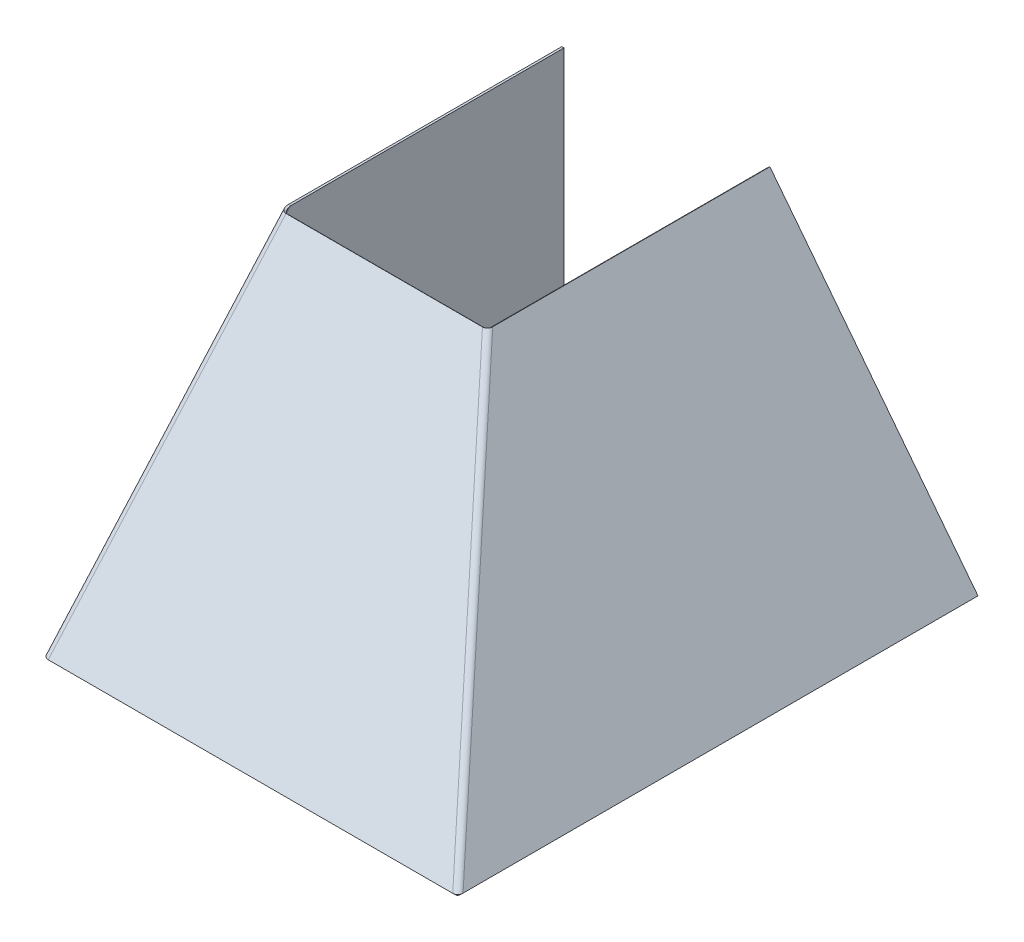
ISO-10303-21;
HEADER;
FILE_DESCRIPTION(('STEP AP214'),'2;1');
FILE_NAME('part.step','',(''),(''),'','','');
FILE_SCHEMA(('AUTOMOTIVE_DESIGN { 1 0 10303 214 1 1 1 1 }'));
ENDSEC;
DATA;
#1=APPLICATION_CONTEXT('core data for automotive mechanical design processes');
#2=APPLICATION_PROTOCOL_DEFINITION('international standard','automotive_design',2000,#1);
#3=PRODUCT_CONTEXT('',#1,'mechanical');
#4=PRODUCT('Part','Part','',(#3));
#5=PRODUCT_RELATED_PRODUCT_CATEGORY('part','',(#4));
#6=PRODUCT_DEFINITION_FORMATION('','',#4);
#7=PRODUCT_DEFINITION_CONTEXT('part definition',#1,'design');
#8=PRODUCT_DEFINITION('design','',#6,#7);
#9=PRODUCT_DEFINITION_SHAPE('','',#8);
#10=(LENGTH_UNIT() NAMED_UNIT(*) SI_UNIT(.MILLI.,.METRE.));
#11=(NAMED_UNIT(*) PLANE_ANGLE_UNIT() SI_UNIT($,.RADIAN.));
#12=(NAMED_UNIT(*) SI_UNIT($,.STERADIAN.) SOLID_ANGLE_UNIT());
#13=UNCERTAINTY_MEASURE_WITH_UNIT(LENGTH_MEASURE(1.E-05),#10,'distance_accuracy_value','');
#14=(GEOMETRIC_REPRESENTATION_CONTEXT(3) GLOBAL_UNCERTAINTY_ASSIGNED_CONTEXT((#13)) GLOBAL_UNIT_ASSIGNED_CONTEXT((#10,
#11,#12)) REPRESENTATION_CONTEXT('',''));
#15=CARTESIAN_POINT('',(0.,0.,0.));
#16=DIRECTION('',(0.,0.,1.));
#17=DIRECTION('',(1.,0.,0.));
#18=AXIS2_PLACEMENT_3D('',#15,#16,#17);
#19=CARTESIAN_POINT('',(0.,0.,0.));
#20=DIRECTION('',(0.,0.74740931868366,-0.66436383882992));
#21=DIRECTION('',(1.,0.,0.));
#22=AXIS2_PLACEMENT_3D('',#19,#20,#21);
#23=PLANE('',#22);
#24=DIRECTION('',(0.,0.66436383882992,0.74740931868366));
#25=VECTOR('',#24,1.);
#26=CARTESIAN_POINT('',(4.50000000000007,0.,0.));
#27=LINE('',#26,#25);
#28=CARTESIAN_POINT('',(4.50000000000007,-0.99654575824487,-1.12111397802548));
#29=VERTEX_POINT('',#28);
#30=CARTESIAN_POINT('',(4.50000000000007,0.,0.));
#31=VERTEX_POINT('',#30);
#32=EDGE_CURVE('E11',#29,#31,#27,.T.);
#33=ORIENTED_EDGE('',*,*,#32,.F.);
#34=DIRECTION('',(1.,0.,0.));
#35=VECTOR('',#34,1.);
#36=CARTESIAN_POINT('',(0.,-0.99654575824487,-1.12111397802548));
#37=LINE('',#36,#35);
#38=CARTESIAN_POINT('',(276.624396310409,-0.99654575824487,-1.12111397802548));
#39=VERTEX_POINT('',#38);
#40=EDGE_CURVE('E94',#29,#39,#37,.T.);
#41=ORIENTED_EDGE('',*,*,#40,.T.);
#42=DIRECTION('',(0.,0.664363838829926,0.747409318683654));
#43=VECTOR('',#42,1.);
#44=CARTESIAN_POINT('',(276.624396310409,0.,0.));
#45=LINE('',#44,#43);
#46=CARTESIAN_POINT('',(276.624396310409,0.,0.));
#47=VERTEX_POINT('',#46);
#48=EDGE_CURVE('E47',#39,#47,#45,.T.);
#49=ORIENTED_EDGE('',*,*,#48,.T.);
#50=DIRECTION('',(1.,0.,0.));
#51=VECTOR('',#50,1.);
#52=CARTESIAN_POINT('',(0.,0.,0.));
#53=LINE('',#52,#51);
#54=EDGE_CURVE('E96',#31,#47,#53,.T.);
#55=ORIENTED_EDGE('',*,*,#54,.F.);
#56=EDGE_LOOP('',(#33,#41,#49,#55));
#57=FACE_BOUND('',#56,.T.);
#58=ADVANCED_FACE('F35',(#57),#23,.F.);
#59=CARTESIAN_POINT('',(278.885076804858,0.,-0.779707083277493));
#60=CARTESIAN_POINT('',(278.67232636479,-0.38159999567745,-1.02285044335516));
#61=CARTESIAN_POINT('',(278.459575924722,-0.763199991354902,-1.26599380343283));
#62=CARTESIAN_POINT('',(278.246825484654,-1.14479998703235,-1.5091371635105));
#63=CARTESIAN_POINT('',(285.65826705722,0.,-6.70624855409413));
#64=CARTESIAN_POINT('',(284.692939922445,-0.381599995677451,-6.29088730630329));
#65=CARTESIAN_POINT('',(283.727612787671,-0.763199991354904,-5.87552605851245));
#66=CARTESIAN_POINT('',(282.762285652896,-1.14479998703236,-5.4601648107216));
#67=CARTESIAN_POINT('',(276.486359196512,0.,-17.1884289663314));
#68=CARTESIAN_POINT('',(275.946532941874,0.381599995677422,-16.2867809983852));
#69=CARTESIAN_POINT('',(275.406706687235,0.763199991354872,-15.385133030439));
#70=CARTESIAN_POINT('',(274.866880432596,1.14479998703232,-14.4834850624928));
#71=CARTESIAN_POINT('',(269.713168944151,0.,-11.2618874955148));
#72=CARTESIAN_POINT('',(269.925919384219,0.381599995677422,-11.0187441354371));
#73=CARTESIAN_POINT('',(270.138669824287,0.763199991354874,-10.7756007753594));
#74=CARTESIAN_POINT('',(270.351420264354,1.14479998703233,-10.5324574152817));
#75=CARTESIAN_POINT('',(262.939978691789,0.,-5.33534602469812));
#76=CARTESIAN_POINT('',(263.905305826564,0.381599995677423,-5.75070727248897));
#77=CARTESIAN_POINT('',(264.870632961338,0.763199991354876,-6.16606852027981));
#78=CARTESIAN_POINT('',(265.835960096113,1.14479998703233,-6.58142976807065));
#79=CARTESIAN_POINT('',(272.111886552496,0.,5.14683438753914));
#80=CARTESIAN_POINT('',(272.651712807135,-0.38159999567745,4.24518641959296));
#81=CARTESIAN_POINT('',(273.191539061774,-0.7631999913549,3.34353845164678));
#82=CARTESIAN_POINT('',(273.731365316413,-1.14479998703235,2.44189048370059));
#83=CARTESIAN_POINT('',(278.885076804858,0.,-0.779707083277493));
#84=CARTESIAN_POINT('',(278.67232636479,-0.38159999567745,-1.02285044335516));
#85=CARTESIAN_POINT('',(278.459575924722,-0.763199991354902,-1.26599380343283));
#86=CARTESIAN_POINT('',(278.246825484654,-1.14479998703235,-1.5091371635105));
#87=(BOUNDED_SURFACE() B_SPLINE_SURFACE(3,3,((#59,#60,#61,#62),(#63,#64,#65,#66),(#67,#68,#69,
#70),(#71,#72,#73,#74),(#75,#76,#77,#78),(#79,#80,#81,#82),(#83,#84,#85,#86)),.UNSPECIFIED.,.T.,
.F.,.F.) B_SPLINE_SURFACE_WITH_KNOTS((4,3,4),(4,4),(0.,0.5,1.),(0.,1.),
.UNSPECIFIED.) GEOMETRIC_REPRESENTATION_ITEM() RATIONAL_B_SPLINE_SURFACE(((1.,1.,1.,1.),
(0.333333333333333,0.333333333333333,0.333333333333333,0.333333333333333),(0.333333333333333,
0.333333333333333,0.333333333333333,0.333333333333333),(1.,1.,1.,1.),(0.333333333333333,
0.333333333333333,0.333333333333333,0.333333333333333),(0.333333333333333,0.333333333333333,
0.333333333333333,0.333333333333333),(1.,1.,1.,1.))) REPRESENTATION_ITEM('') SURFACE());
#88=CARTESIAN_POINT('',(274.299122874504,0.,-6.02079728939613));
#89=DIRECTION('',(-0.123516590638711,-0.982250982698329,-0.141161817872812));
#90=DIRECTION('',(0.646816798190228,-0.187571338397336,0.739219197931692));
#91=AXIS2_PLACEMENT_3D('',#88,#89,#90);
#92=ELLIPSE('',#91,6.10327780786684,3.);
#93=CARTESIAN_POINT('',(278.815971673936,-0.920910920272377,-3.56503483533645));
#94=VERTEX_POINT('',#93);
#95=EDGE_CURVE('E135',#39,#94,#92,.F.);
#96=DIRECTION('',(0.789352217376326,0.61394061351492,0.));
#97=VECTOR('',#96,1.);
#98=CARTESIAN_POINT('',(280.,0.,-3.56503483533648));
#99=LINE('',#98,#97);
#100=CARTESIAN_POINT('',(280.,0.,-3.56503483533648));
#101=VERTEX_POINT('',#100);
#102=EDGE_CURVE('E162',#94,#101,#99,.T.);
#103=CARTESIAN_POINT('',(274.299122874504,0.,-6.02079728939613));
#104=DIRECTION('',(0.,-1.,0.));
#105=DIRECTION('',(0.658504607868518,0.,0.752576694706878));
#106=AXIS2_PLACEMENT_3D('',#103,#104,#105);
#107=ELLIPSE('',#106,6.96419413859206,4.5);
#108=EDGE_CURVE('E171',#47,#101,#107,.F.);
#109=ORIENTED_EDGE('',*,*,#48,.F.);
#110=ORIENTED_EDGE('',*,*,#95,.T.);
#111=ORIENTED_EDGE('',*,*,#102,.T.);
#112=ORIENTED_EDGE('',*,*,#108,.F.);
#113=EDGE_LOOP('',(#109,#110,#111,#112));
#114=FACE_BOUND('',#113,.T.);
#115=ADVANCED_FACE('F170',(#114),#87,.F.);
#116=CARTESIAN_POINT('',(280.,0.,0.));
#117=DIRECTION('',(-0.61394061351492,0.789352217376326,0.));
#118=DIRECTION('',(0.,0.,-1.));
#119=AXIS2_PLACEMENT_3D('',#116,#117,#118);
#120=PLANE('',#119);
#121=ORIENTED_EDGE('',*,*,#102,.F.);
#122=DIRECTION('',(0.,0.,1.));
#123=VECTOR('',#122,1.);
#124=CARTESIAN_POINT('',(278.815971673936,-0.920910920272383,0.));
#125=LINE('',#124,#123);
#126=CARTESIAN_POINT('',(278.815971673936,-0.920910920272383,-350.));
#127=VERTEX_POINT('',#126);
#128=EDGE_CURVE('E226',#94,#127,#125,.F.);
#129=ORIENTED_EDGE('',*,*,#128,.T.);
#130=DIRECTION('',(0.789352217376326,0.61394061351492,0.));
#131=VECTOR('',#130,1.);
#132=CARTESIAN_POINT('',(280.,0.,-350.));
#133=LINE('',#132,#131);
#134=CARTESIAN_POINT('',(280.,0.,-350.));
#135=VERTEX_POINT('',#134);
#136=EDGE_CURVE('E159',#127,#135,#133,.T.);
#137=ORIENTED_EDGE('',*,*,#136,.T.);
#138=DIRECTION('',(0.,0.,-1.));
#139=VECTOR('',#138,1.);
#140=CARTESIAN_POINT('',(280.,0.,0.));
#141=LINE('',#140,#139);
#142=EDGE_CURVE('E190',#101,#135,#141,.T.);
#143=ORIENTED_EDGE('',*,*,#142,.F.);
#144=EDGE_LOOP('',(#121,#129,#137,#143));
#145=FACE_BOUND('',#144,.T.);
#146=ADVANCED_FACE('F191',(#145),#120,.F.);
#147=CARTESIAN_POINT('',(140.,180.,-350.));
#148=DIRECTION('',(0.,0.,-1.));
#149=DIRECTION('',(0.61394061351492,-0.789352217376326,0.));
#150=AXIS2_PLACEMENT_3D('',#147,#148,#149);
#151=PLANE('',#150);
#152=ORIENTED_EDGE('',*,*,#136,.F.);
#153=DIRECTION('',(0.61394061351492,-0.789352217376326,0.));
#154=VECTOR('',#153,1.);
#155=CARTESIAN_POINT('',(173.277510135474,134.771396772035,-350.));
#156=LINE('',#155,#154);
#157=CARTESIAN_POINT('',(138.815971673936,179.079089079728,-350.));
#158=VERTEX_POINT('',#157);
#159=EDGE_CURVE('E230',#158,#127,#156,.T.);
#160=ORIENTED_EDGE('',*,*,#159,.F.);
#161=DIRECTION('',(0.789352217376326,0.61394061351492,0.));
#162=VECTOR('',#161,1.);
#163=CARTESIAN_POINT('',(140.,180.,-350.));
#164=LINE('',#163,#162);
#165=CARTESIAN_POINT('',(140.,180.,-350.));
#166=VERTEX_POINT('',#165);
#167=EDGE_CURVE('E156',#158,#166,#164,.T.);
#168=ORIENTED_EDGE('',*,*,#167,.T.);
#169=DIRECTION('',(0.61394061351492,-0.789352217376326,0.));
#170=VECTOR('',#169,1.);
#171=CARTESIAN_POINT('',(140.,180.,-350.));
#172=LINE('',#171,#170);
#173=EDGE_CURVE('E197',#166,#135,#172,.T.);
#174=ORIENTED_EDGE('',*,*,#173,.T.);
#175=EDGE_LOOP('',(#152,#160,#168,#174));
#176=FACE_BOUND('',#175,.T.);
#177=ADVANCED_FACE('F241',(#176),#151,.T.);
#178=CARTESIAN_POINT('',(140.,180.,-160.));
#179=DIRECTION('',(-0.61394061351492,0.789352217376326,0.));
#180=DIRECTION('',(0.,0.,-1.));
#181=AXIS2_PLACEMENT_3D('',#178,#179,#180);
#182=PLANE('',#181);
#183=ORIENTED_EDGE('',*,*,#167,.F.);
#184=DIRECTION('',(0.,0.,1.));
#185=VECTOR('',#184,1.);
#186=CARTESIAN_POINT('',(138.815971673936,179.079089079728,0.));
#187=LINE('',#186,#185);
#188=CARTESIAN_POINT('',(138.815971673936,179.079089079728,-163.565034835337));
#189=VERTEX_POINT('',#188);
#190=EDGE_CURVE('E132',#189,#158,#187,.F.);
#191=ORIENTED_EDGE('',*,*,#190,.F.);
#192=DIRECTION('',(0.789352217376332,0.613940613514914,0.));
#193=VECTOR('',#192,1.);
#194=CARTESIAN_POINT('',(140.,180.,-163.565034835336));
#195=LINE('',#194,#193);
#196=CARTESIAN_POINT('',(140.,180.,-163.565034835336));
#197=VERTEX_POINT('',#196);
#198=EDGE_CURVE('E153',#189,#197,#195,.T.);
#199=ORIENTED_EDGE('',*,*,#198,.T.);
#200=DIRECTION('',(0.,0.,-1.));
#201=VECTOR('',#200,1.);
#202=CARTESIAN_POINT('',(140.,180.,-160.));
#203=LINE('',#202,#201);
#204=EDGE_CURVE('E202',#197,#166,#203,.T.);
#205=ORIENTED_EDGE('',*,*,#204,.T.);
#206=EDGE_LOOP('',(#183,#191,#199,#205));
#207=FACE_BOUND('',#206,.T.);
#208=ADVANCED_FACE('F290',(#207),#182,.T.);
#209=CARTESIAN_POINT('',(138.885076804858,180.,-160.779707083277));
#210=CARTESIAN_POINT('',(138.67232636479,179.618400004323,-161.022850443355));
#211=CARTESIAN_POINT('',(138.459575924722,179.236800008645,-161.265993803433));
#212=CARTESIAN_POINT('',(138.246825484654,178.855200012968,-161.509137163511));
#213=CARTESIAN_POINT('',(132.111886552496,180.,-154.853165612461));
#214=CARTESIAN_POINT('',(132.651712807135,179.618400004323,-155.754813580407));
#215=CARTESIAN_POINT('',(133.191539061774,179.236800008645,-156.656461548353));
#216=CARTESIAN_POINT('',(133.731365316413,178.855200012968,-157.558109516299));
#217=CARTESIAN_POINT('',(122.939978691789,180.,-165.335346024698));
#218=CARTESIAN_POINT('',(123.905305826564,180.381599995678,-165.750707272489));
#219=CARTESIAN_POINT('',(124.870632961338,180.763199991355,-166.16606852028));
#220=CARTESIAN_POINT('',(125.835960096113,181.144799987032,-166.581429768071));
#221=CARTESIAN_POINT('',(129.713168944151,180.,-171.261887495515));
#222=CARTESIAN_POINT('',(129.925919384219,180.381599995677,-171.018744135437));
#223=CARTESIAN_POINT('',(130.138669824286,180.763199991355,-170.775600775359));
#224=CARTESIAN_POINT('',(130.351420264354,181.144799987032,-170.532457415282));
#225=CARTESIAN_POINT('',(136.486359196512,180.,-177.188428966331));
#226=CARTESIAN_POINT('',(135.946532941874,180.381599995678,-176.286780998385));
#227=CARTESIAN_POINT('',(135.406706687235,180.763199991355,-175.385133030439));
#228=CARTESIAN_POINT('',(134.866880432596,181.144799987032,-174.483485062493));
#229=CARTESIAN_POINT('',(145.65826705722,180.,-166.706248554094));
#230=CARTESIAN_POINT('',(144.692939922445,179.618400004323,-166.290887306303));
#231=CARTESIAN_POINT('',(143.72761278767,179.236800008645,-165.875526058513));
#232=CARTESIAN_POINT('',(142.762285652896,178.855200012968,-165.460164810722));
#233=CARTESIAN_POINT('',(138.885076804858,180.,-160.779707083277));
#234=CARTESIAN_POINT('',(138.67232636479,179.618400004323,-161.022850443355));
#235=CARTESIAN_POINT('',(138.459575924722,179.236800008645,-161.265993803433));
#236=CARTESIAN_POINT('',(138.246825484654,178.855200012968,-161.509137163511));
#237=(BOUNDED_SURFACE() B_SPLINE_SURFACE(3,3,((#209,#210,#211,#212),(#213,#214,#215,#216),(#217,
#218,#219,#220),(#221,#222,#223,#224),(#225,#226,#227,#228),(#229,#230,#231,#232),(#233,#234,
#235,#236)),.UNSPECIFIED.,.T.,.F.,.F.) B_SPLINE_SURFACE_WITH_KNOTS((4,3,4),(4,4),(0.,0.5,1.),
(0.,1.),.UNSPECIFIED.) GEOMETRIC_REPRESENTATION_ITEM() RATIONAL_B_SPLINE_SURFACE(((1.,1.,1.,1.),
(0.333333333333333,0.333333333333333,0.333333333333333,0.333333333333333),(0.333333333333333,
0.333333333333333,0.333333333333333,0.333333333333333),(1.,1.,1.,1.),(0.333333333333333,
0.333333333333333,0.333333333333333,0.333333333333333),(0.333333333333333,0.333333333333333,
0.333333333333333,0.333333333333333),(1.,1.,1.,1.))) REPRESENTATION_ITEM('') SURFACE());
#238=CARTESIAN_POINT('',(134.299122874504,180.,-166.020797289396));
#239=DIRECTION('',(0.123516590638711,0.982250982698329,0.141161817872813));
#240=DIRECTION('',(0.64681679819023,-0.187571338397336,0.73921919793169));
#241=AXIS2_PLACEMENT_3D('',#238,#239,#240);
#242=ELLIPSE('',#241,6.10327780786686,3.);
#243=CARTESIAN_POINT('',(136.624396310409,179.003454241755,-161.121113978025));
#244=VERTEX_POINT('',#243);
#245=EDGE_CURVE('E130',#189,#244,#242,.F.);
#246=DIRECTION('',(0.,0.66436383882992,0.74740931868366));
#247=VECTOR('',#246,1.);
#248=CARTESIAN_POINT('',(136.624396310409,180.,-160.));
#249=LINE('',#248,#247);
#250=CARTESIAN_POINT('',(136.624396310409,180.,-160.));
#251=VERTEX_POINT('',#250);
#252=EDGE_CURVE('E151',#244,#251,#249,.T.);
#253=CARTESIAN_POINT('',(134.299122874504,180.,-166.020797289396));
#254=DIRECTION('',(0.,1.,0.));
#255=DIRECTION('',(0.658504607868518,0.,0.752576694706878));
#256=AXIS2_PLACEMENT_3D('',#253,#254,#255);
#257=ELLIPSE('',#256,6.96419413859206,4.5);
#258=EDGE_CURVE('E187',#197,#251,#257,.F.);
#259=ORIENTED_EDGE('',*,*,#198,.F.);
#260=ORIENTED_EDGE('',*,*,#245,.T.);
#261=ORIENTED_EDGE('',*,*,#252,.T.);
#262=ORIENTED_EDGE('',*,*,#258,.F.);
#263=EDGE_LOOP('',(#259,#260,#261,#262));
#264=FACE_BOUND('',#263,.T.);
#265=ADVANCED_FACE('F292',(#264),#237,.F.);
#266=CARTESIAN_POINT('',(0.,180.,-160.));
#267=DIRECTION('',(0.,0.74740931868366,-0.66436383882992));
#268=DIRECTION('',(1.,0.,0.));
#269=AXIS2_PLACEMENT_3D('',#266,#267,#268);
#270=PLANE('',#269);
#271=ORIENTED_EDGE('',*,*,#252,.F.);
#272=DIRECTION('',(1.,0.,0.));
#273=VECTOR('',#272,1.);
#274=CARTESIAN_POINT('',(0.,179.003454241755,-161.121113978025));
#275=LINE('',#274,#273);
#276=CARTESIAN_POINT('',(4.50000000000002,179.003454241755,-161.121113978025));
#277=VERTEX_POINT('',#276);
#278=EDGE_CURVE('E125',#277,#244,#275,.T.);
#279=ORIENTED_EDGE('',*,*,#278,.F.);
#280=DIRECTION('',(0.,0.664363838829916,0.747409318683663));
#281=VECTOR('',#280,1.);
#282=CARTESIAN_POINT('',(4.50000000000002,180.,-160.));
#283=LINE('',#282,#281);
#284=CARTESIAN_POINT('',(4.50000000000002,180.,-160.));
#285=VERTEX_POINT('',#284);
#286=EDGE_CURVE('E148',#277,#285,#283,.T.);
#287=ORIENTED_EDGE('',*,*,#286,.T.);
#288=DIRECTION('',(1.,0.,0.));
#289=VECTOR('',#288,1.);
#290=CARTESIAN_POINT('',(0.,180.,-160.));
#291=LINE('',#290,#289);
#292=EDGE_CURVE('E196',#285,#251,#291,.T.);
#293=ORIENTED_EDGE('',*,*,#292,.T.);
#294=EDGE_LOOP('',(#271,#279,#287,#293));
#295=FACE_BOUND('',#294,.T.);
#296=ADVANCED_FACE('F295',(#295),#270,.T.);
#297=CARTESIAN_POINT('',(4.50000000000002,180.,-160.));
#298=CARTESIAN_POINT('',(4.50000000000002,179.667818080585,-160.373704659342));
#299=CARTESIAN_POINT('',(4.50000000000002,179.33563616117,-160.747409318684));
#300=CARTESIAN_POINT('',(4.50000000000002,179.003454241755,-161.121113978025));
#301=CARTESIAN_POINT('',(-4.49999999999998,180.,-160.));
#302=CARTESIAN_POINT('',(-3.49999999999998,179.667818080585,-160.373704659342));
#303=CARTESIAN_POINT('',(-2.49999999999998,179.33563616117,-160.747409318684));
#304=CARTESIAN_POINT('',(-1.49999999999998,179.003454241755,-161.121113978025));
#305=CARTESIAN_POINT('',(-4.49999999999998,180.,-172.041594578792));
#306=CARTESIAN_POINT('',(-3.49999999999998,180.332181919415,-171.667889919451));
#307=CARTESIAN_POINT('',(-2.49999999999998,180.66436383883,-171.294185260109));
#308=CARTESIAN_POINT('',(-1.49999999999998,180.996545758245,-170.920480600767));
#309=CARTESIAN_POINT('',(4.50000000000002,180.,-172.041594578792));
#310=CARTESIAN_POINT('',(4.50000000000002,180.332181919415,-171.66788991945));
#311=CARTESIAN_POINT('',(4.50000000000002,180.66436383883,-171.294185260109));
#312=CARTESIAN_POINT('',(4.50000000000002,180.996545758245,-170.920480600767));
#313=CARTESIAN_POINT('',(13.5,180.,-172.041594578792));
#314=CARTESIAN_POINT('',(12.5,180.332181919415,-171.667889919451));
#315=CARTESIAN_POINT('',(11.5,180.66436383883,-171.294185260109));
#316=CARTESIAN_POINT('',(10.5,180.996545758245,-170.920480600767));
#317=CARTESIAN_POINT('',(13.5,180.,-160.));
#318=CARTESIAN_POINT('',(12.5,179.667818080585,-160.373704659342));
#319=CARTESIAN_POINT('',(11.5,179.33563616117,-160.747409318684));
#320=CARTESIAN_POINT('',(10.5,179.003454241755,-161.121113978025));
#321=CARTESIAN_POINT('',(4.50000000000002,180.,-160.));
#322=CARTESIAN_POINT('',(4.50000000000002,179.667818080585,-160.373704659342));
#323=CARTESIAN_POINT('',(4.50000000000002,179.33563616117,-160.747409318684));
#324=CARTESIAN_POINT('',(4.50000000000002,179.003454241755,-161.121113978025));
#325=(BOUNDED_SURFACE() B_SPLINE_SURFACE(3,3,((#297,#298,#299,#300),(#301,#302,#303,#304),(#305,
#306,#307,#308),(#309,#310,#311,#312),(#313,#314,#315,#316),(#317,#318,#319,#320),(#321,#322,
#323,#324)),.UNSPECIFIED.,.T.,.F.,.F.) B_SPLINE_SURFACE_WITH_KNOTS((4,3,4),(4,4),(0.,0.5,1.),
(0.,1.),.UNSPECIFIED.) GEOMETRIC_REPRESENTATION_ITEM() RATIONAL_B_SPLINE_SURFACE(((1.,1.,1.,1.),
(0.333333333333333,0.333333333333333,0.333333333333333,0.333333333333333),(0.333333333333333,
0.333333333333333,0.333333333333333,0.333333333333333),(1.,1.,1.,1.),(0.333333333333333,
0.333333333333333,0.333333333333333,0.333333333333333),(0.333333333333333,0.333333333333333,
0.333333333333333,0.333333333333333),(1.,1.,1.,1.))) REPRESENTATION_ITEM('') SURFACE());
#326=CARTESIAN_POINT('',(4.50000000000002,180.,-166.020797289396));
#327=DIRECTION('',(0.,0.979936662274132,0.199309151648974));
#328=DIRECTION('',(0.,-0.199309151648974,0.979936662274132));
#329=AXIS2_PLACEMENT_3D('',#326,#327,#328);
#330=ELLIPSE('',#329,5.00000000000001,3.);
#331=CARTESIAN_POINT('',(1.50000000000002,180.,-166.020797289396));
#332=VERTEX_POINT('',#331);
#333=EDGE_CURVE('E112',#277,#332,#330,.F.);
#334=DIRECTION('',(-1.,0.,0.));
#335=VECTOR('',#334,1.);
#336=CARTESIAN_POINT('',(0.,180.,-166.020797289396));
#337=LINE('',#336,#335);
#338=CARTESIAN_POINT('',(0.,180.,-166.020797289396));
#339=VERTEX_POINT('',#338);
#340=EDGE_CURVE('E145',#332,#339,#337,.T.);
#341=CARTESIAN_POINT('',(4.50000000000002,180.,-166.020797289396));
#342=DIRECTION('',(0.,1.,0.));
#343=DIRECTION('',(0.,0.,1.));
#344=AXIS2_PLACEMENT_3D('',#341,#342,#343);
#345=ELLIPSE('',#344,6.02079728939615,4.5);
#346=EDGE_CURVE('E211',#285,#339,#345,.F.);
#347=ORIENTED_EDGE('',*,*,#286,.F.);
#348=ORIENTED_EDGE('',*,*,#333,.T.);
#349=ORIENTED_EDGE('',*,*,#340,.T.);
#350=ORIENTED_EDGE('',*,*,#346,.F.);
#351=EDGE_LOOP('',(#347,#348,#349,#350));
#352=FACE_BOUND('',#351,.T.);
#353=ADVANCED_FACE('F335',(#352),#325,.F.);
#354=CARTESIAN_POINT('',(0.,180.,-350.));
#355=DIRECTION('',(0.,1.,0.));
#356=DIRECTION('',(0.,0.,1.));
#357=AXIS2_PLACEMENT_3D('',#354,#355,#356);
#358=PLANE('',#357);
#359=ORIENTED_EDGE('',*,*,#340,.F.);
#360=DIRECTION('',(0.,0.,-1.));
#361=VECTOR('',#360,1.);
#362=CARTESIAN_POINT('',(1.50000000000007,180.,0.));
#363=LINE('',#362,#361);
#364=CARTESIAN_POINT('',(1.49999999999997,180.,-350.));
#365=VERTEX_POINT('',#364);
#366=EDGE_CURVE('E221',#365,#332,#363,.F.);
#367=ORIENTED_EDGE('',*,*,#366,.F.);
#368=DIRECTION('',(-1.,0.,0.));
#369=VECTOR('',#368,1.);
#370=CARTESIAN_POINT('',(0.,180.,-350.));
#371=LINE('',#370,#369);
#372=CARTESIAN_POINT('',(0.,180.,-350.));
#373=VERTEX_POINT('',#372);
#374=EDGE_CURVE('E142',#365,#373,#371,.T.);
#375=ORIENTED_EDGE('',*,*,#374,.T.);
#376=DIRECTION('',(0.,0.,1.));
#377=VECTOR('',#376,1.);
#378=CARTESIAN_POINT('',(0.,180.,-350.));
#379=LINE('',#378,#377);
#380=EDGE_CURVE('E262',#373,#339,#379,.T.);
#381=ORIENTED_EDGE('',*,*,#380,.T.);
#382=EDGE_LOOP('',(#359,#367,#375,#381));
#383=FACE_BOUND('',#382,.T.);
#384=ADVANCED_FACE('F263',(#383),#358,.T.);
#385=CARTESIAN_POINT('',(0.,0.,-350.));
#386=DIRECTION('',(0.,0.,-1.));
#387=DIRECTION('',(0.,1.,0.));
#388=AXIS2_PLACEMENT_3D('',#385,#386,#387);
#389=PLANE('',#388);
#390=ORIENTED_EDGE('',*,*,#374,.F.);
#391=DIRECTION('',(0.,1.,0.));
#392=VECTOR('',#391,1.);
#393=CARTESIAN_POINT('',(1.49999999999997,0.,-350.));
#394=LINE('',#393,#392);
#395=CARTESIAN_POINT('',(1.49999999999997,0.,-350.));
#396=VERTEX_POINT('',#395);
#397=EDGE_CURVE('E124',#396,#365,#394,.T.);
#398=ORIENTED_EDGE('',*,*,#397,.F.);
#399=DIRECTION('',(-1.,0.,0.));
#400=VECTOR('',#399,1.);
#401=CARTESIAN_POINT('',(0.,0.,-350.));
#402=LINE('',#401,#400);
#403=CARTESIAN_POINT('',(0.,0.,-350.));
#404=VERTEX_POINT('',#403);
#405=EDGE_CURVE('E139',#396,#404,#402,.T.);
#406=ORIENTED_EDGE('',*,*,#405,.T.);
#407=DIRECTION('',(0.,1.,0.));
#408=VECTOR('',#407,1.);
#409=CARTESIAN_POINT('',(0.,0.,-350.));
#410=LINE('',#409,#408);
#411=EDGE_CURVE('E268',#404,#373,#410,.T.);
#412=ORIENTED_EDGE('',*,*,#411,.T.);
#413=EDGE_LOOP('',(#390,#398,#406,#412));
#414=FACE_BOUND('',#413,.T.);
#415=ADVANCED_FACE('F282',(#414),#389,.T.);
#416=CARTESIAN_POINT('',(0.,0.,-350.));
#417=DIRECTION('',(0.,1.,0.));
#418=DIRECTION('',(0.,0.,1.));
#419=AXIS2_PLACEMENT_3D('',#416,#417,#418);
#420=PLANE('',#419);
#421=ORIENTED_EDGE('',*,*,#405,.F.);
#422=DIRECTION('',(0.,0.,-1.));
#423=VECTOR('',#422,1.);
#424=CARTESIAN_POINT('',(1.50000000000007,0.,0.));
#425=LINE('',#424,#423);
#426=CARTESIAN_POINT('',(1.50000000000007,0.,-6.02079728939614));
#427=VERTEX_POINT('',#426);
#428=EDGE_CURVE('E117',#396,#427,#425,.F.);
#429=ORIENTED_EDGE('',*,*,#428,.T.);
#430=DIRECTION('',(-1.,0.,0.));
#431=VECTOR('',#430,1.);
#432=CARTESIAN_POINT('',(0.,0.,-6.02079728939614));
#433=LINE('',#432,#431);
#434=CARTESIAN_POINT('',(0.,0.,-6.02079728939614));
#435=VERTEX_POINT('',#434);
#436=EDGE_CURVE('E41',#427,#435,#433,.T.);
#437=ORIENTED_EDGE('',*,*,#436,.T.);
#438=DIRECTION('',(0.,0.,1.));
#439=VECTOR('',#438,1.);
#440=CARTESIAN_POINT('',(0.,0.,-350.));
#441=LINE('',#440,#439);
#442=EDGE_CURVE('E248',#404,#435,#441,.T.);
#443=ORIENTED_EDGE('',*,*,#442,.F.);
#444=EDGE_LOOP('',(#421,#429,#437,#443));
#445=FACE_BOUND('',#444,.T.);
#446=ADVANCED_FACE('F349',(#445),#420,.F.);
#447=CARTESIAN_POINT('',(4.50000000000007,0.,0.));
#448=CARTESIAN_POINT('',(4.50000000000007,-0.33218191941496,-0.373704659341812));
#449=CARTESIAN_POINT('',(4.50000000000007,-0.664363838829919,-0.747409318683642));
#450=CARTESIAN_POINT('',(4.50000000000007,-0.996545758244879,-1.12111397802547));
#451=CARTESIAN_POINT('',(13.5000000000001,0.,0.));
#452=CARTESIAN_POINT('',(12.5000000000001,-0.33218191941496,-0.373704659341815));
#453=CARTESIAN_POINT('',(11.5000000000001,-0.66436383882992,-0.747409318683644));
#454=CARTESIAN_POINT('',(10.5000000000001,-0.996545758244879,-1.12111397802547));
#455=CARTESIAN_POINT('',(13.5000000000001,0.,-12.0415945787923));
#456=CARTESIAN_POINT('',(12.5000000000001,0.33218191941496,-11.6678899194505));
#457=CARTESIAN_POINT('',(11.5000000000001,0.66436383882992,-11.2941852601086));
#458=CARTESIAN_POINT('',(10.5000000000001,0.99654575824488,-10.9204806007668));
#459=CARTESIAN_POINT('',(4.50000000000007,0.,-12.0415945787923));
#460=CARTESIAN_POINT('',(4.50000000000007,0.33218191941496,-11.6678899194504));
#461=CARTESIAN_POINT('',(4.50000000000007,0.664363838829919,-11.2941852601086));
#462=CARTESIAN_POINT('',(4.50000000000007,0.996545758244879,-10.9204806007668));
#463=CARTESIAN_POINT('',(-4.49999999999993,0.,-12.0415945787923));
#464=CARTESIAN_POINT('',(-3.49999999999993,0.33218191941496,-11.6678899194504));
#465=CARTESIAN_POINT('',(-2.49999999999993,0.66436383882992,-11.2941852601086));
#466=CARTESIAN_POINT('',(-1.49999999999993,0.996545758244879,-10.9204806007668));
#467=CARTESIAN_POINT('',(-4.49999999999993,0.,0.));
#468=CARTESIAN_POINT('',(-3.49999999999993,-0.33218191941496,-0.37370465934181));
#469=CARTESIAN_POINT('',(-2.49999999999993,-0.66436383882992,-0.74740931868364));
#470=CARTESIAN_POINT('',(-1.49999999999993,-0.996545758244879,-1.12111397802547));
#471=CARTESIAN_POINT('',(4.50000000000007,0.,0.));
#472=CARTESIAN_POINT('',(4.50000000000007,-0.33218191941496,-0.373704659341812));
#473=CARTESIAN_POINT('',(4.50000000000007,-0.664363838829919,-0.747409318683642));
#474=CARTESIAN_POINT('',(4.50000000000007,-0.996545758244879,-1.12111397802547));
#475=(BOUNDED_SURFACE() B_SPLINE_SURFACE(3,3,((#447,#448,#449,#450),(#451,#452,#453,#454),(#455,
#456,#457,#458),(#459,#460,#461,#462),(#463,#464,#465,#466),(#467,#468,#469,#470),(#471,#472,
#473,#474)),.UNSPECIFIED.,.T.,.F.,.F.) B_SPLINE_SURFACE_WITH_KNOTS((4,3,4),(4,4),(0.,0.5,1.),
(0.,1.),.UNSPECIFIED.) GEOMETRIC_REPRESENTATION_ITEM() RATIONAL_B_SPLINE_SURFACE(((1.,1.,1.,1.),
(0.333333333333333,0.333333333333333,0.333333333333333,0.333333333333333),(0.333333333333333,
0.333333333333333,0.333333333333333,0.333333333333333),(1.,1.,1.,1.),(0.333333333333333,
0.333333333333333,0.333333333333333,0.333333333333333),(0.333333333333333,0.333333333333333,
0.333333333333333,0.333333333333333),(1.,1.,1.,1.))) REPRESENTATION_ITEM('') SURFACE());
#476=CARTESIAN_POINT('',(4.50000000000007,0.,-6.02079728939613));
#477=DIRECTION('',(0.,-0.979936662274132,-0.199309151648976));
#478=DIRECTION('',(0.,-0.199309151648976,0.979936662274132));
#479=AXIS2_PLACEMENT_3D('',#476,#477,#478);
#480=ELLIPSE('',#479,5.,3.);
#481=EDGE_CURVE('E109',#427,#29,#480,.F.);
#482=CARTESIAN_POINT('',(4.50000000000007,0.,-6.02079728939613));
#483=DIRECTION('',(0.,-1.,0.));
#484=DIRECTION('',(0.,0.,1.));
#485=AXIS2_PLACEMENT_3D('',#482,#483,#484);
#486=ELLIPSE('',#485,6.02079728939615,4.5);
#487=EDGE_CURVE('E215',#435,#31,#486,.F.);
#488=ORIENTED_EDGE('',*,*,#481,.T.);
#489=ORIENTED_EDGE('',*,*,#32,.T.);
#490=ORIENTED_EDGE('',*,*,#487,.F.);
#491=ORIENTED_EDGE('',*,*,#436,.F.);
#492=EDGE_LOOP('',(#488,#489,#490,#491));
#493=FACE_BOUND('',#492,.T.);
#494=ADVANCED_FACE('F37',(#493),#475,.F.);
#495=CARTESIAN_POINT('',(0.,0.,0.));
#496=DIRECTION('',(1.,0.,0.));
#497=DIRECTION('',(0.,0.,-1.));
#498=AXIS2_PLACEMENT_3D('',#495,#496,#497);
#499=PLANE('',#498);
#500=ORIENTED_EDGE('',*,*,#442,.T.);
#501=DIRECTION('',(0.,-0.74740931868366,0.66436383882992));
#502=VECTOR('',#501,1.);
#503=CARTESIAN_POINT('',(0.,-2.98963727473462,-3.36334193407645));
#504=LINE('',#503,#502);
#505=EDGE_CURVE('E204',#435,#339,#504,.F.);
#506=ORIENTED_EDGE('',*,*,#505,.T.);
#507=ORIENTED_EDGE('',*,*,#380,.F.);
#508=ORIENTED_EDGE('',*,*,#411,.F.);
#509=EDGE_LOOP('',(#500,#506,#507,#508));
#510=FACE_BOUND('',#509,.T.);
#511=ADVANCED_FACE('F271',(#510),#499,.F.);
#512=CARTESIAN_POINT('',(0.,0.,0.));
#513=DIRECTION('',(0.,-0.66436383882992,-0.74740931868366));
#514=DIRECTION('',(0.,0.74740931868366,-0.66436383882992));
#515=AXIS2_PLACEMENT_3D('',#512,#513,#514);
#516=PLANE('',#515);
#517=ORIENTED_EDGE('',*,*,#54,.T.);
#518=DIRECTION('',(0.502570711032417,-0.646162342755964,0.574366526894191));
#519=VECTOR('',#518,1.);
#520=CARTESIAN_POINT('',(206.75534775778,89.8316338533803,-79.8503412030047));
#521=LINE('',#520,#519);
#522=EDGE_CURVE('E186',#47,#251,#521,.F.);
#523=ORIENTED_EDGE('',*,*,#522,.T.);
#524=ORIENTED_EDGE('',*,*,#292,.F.);
#525=DIRECTION('',(0.,-0.74740931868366,0.66436383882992));
#526=VECTOR('',#525,1.);
#527=CARTESIAN_POINT('',(4.50000000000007,0.,0.));
#528=LINE('',#527,#526);
#529=EDGE_CURVE('E208',#285,#31,#528,.T.);
#530=ORIENTED_EDGE('',*,*,#529,.T.);
#531=EDGE_LOOP('',(#517,#523,#524,#530));
#532=FACE_BOUND('',#531,.T.);
#533=ADVANCED_FACE('F296',(#532),#516,.F.);
#534=CARTESIAN_POINT('',(174.461538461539,135.692307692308,0.));
#535=DIRECTION('',(-0.789352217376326,-0.61394061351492,0.));
#536=DIRECTION('',(0.61394061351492,-0.789352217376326,0.));
#537=AXIS2_PLACEMENT_3D('',#534,#535,#536);
#538=PLANE('',#537);
#539=ORIENTED_EDGE('',*,*,#204,.F.);
#540=DIRECTION('',(0.502570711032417,-0.646162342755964,0.574366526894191));
#541=VECTOR('',#540,1.);
#542=CARTESIAN_POINT('',(210.307432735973,89.6047293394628,-83.2136831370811));
#543=LINE('',#542,#541);
#544=EDGE_CURVE('E184',#197,#101,#543,.T.);
#545=ORIENTED_EDGE('',*,*,#544,.T.);
#546=ORIENTED_EDGE('',*,*,#142,.T.);
#547=ORIENTED_EDGE('',*,*,#173,.F.);
#548=EDGE_LOOP('',(#539,#545,#546,#547));
#549=FACE_BOUND('',#548,.T.);
#550=ADVANCED_FACE('F200',(#549),#538,.F.);
#551=CARTESIAN_POINT('',(4.50000000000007,-2.98963727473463,-3.36334193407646));
#552=DIRECTION('',(0.,-0.74740931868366,0.66436383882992));
#553=DIRECTION('',(0.,-0.66436383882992,-0.74740931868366));
#554=AXIS2_PLACEMENT_3D('',#551,#552,#553);
#555=CYLINDRICAL_SURFACE('',#554,4.5);
#556=ORIENTED_EDGE('',*,*,#346,.T.);
#557=ORIENTED_EDGE('',*,*,#505,.F.);
#558=ORIENTED_EDGE('',*,*,#487,.T.);
#559=ORIENTED_EDGE('',*,*,#529,.F.);
#560=EDGE_LOOP('',(#556,#557,#558,#559));
#561=FACE_BOUND('',#560,.T.);
#562=ADVANCED_FACE('F255',(#561),#555,.T.);
#563=CARTESIAN_POINT('',(206.75534775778,86.8419965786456,-83.2136831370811));
#564=DIRECTION('',(0.502570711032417,-0.646162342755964,0.574366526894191));
#565=DIRECTION('',(0.,-0.66436383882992,-0.74740931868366));
#566=AXIS2_PLACEMENT_3D('',#563,#564,#565);
#567=CYLINDRICAL_SURFACE('',#566,4.5);
#568=ORIENTED_EDGE('',*,*,#258,.T.);
#569=ORIENTED_EDGE('',*,*,#522,.F.);
#570=ORIENTED_EDGE('',*,*,#108,.T.);
#571=ORIENTED_EDGE('',*,*,#544,.F.);
#572=EDGE_LOOP('',(#568,#569,#570,#571));
#573=FACE_BOUND('',#572,.T.);
#574=ADVANCED_FACE('F182',(#573),#567,.T.);
#575=CARTESIAN_POINT('',(1.50000000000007,0.,0.));
#576=DIRECTION('',(1.,0.,0.));
#577=DIRECTION('',(0.,0.,-1.));
#578=AXIS2_PLACEMENT_3D('',#575,#576,#577);
#579=PLANE('',#578);
#580=ORIENTED_EDGE('',*,*,#428,.F.);
#581=ORIENTED_EDGE('',*,*,#397,.T.);
#582=ORIENTED_EDGE('',*,*,#366,.T.);
#583=DIRECTION('',(0.,-0.74740931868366,0.66436383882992));
#584=VECTOR('',#583,1.);
#585=CARTESIAN_POINT('',(1.50000000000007,-2.98963727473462,-3.36334193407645));
#586=LINE('',#585,#584);
#587=EDGE_CURVE('E116',#427,#332,#586,.F.);
#588=ORIENTED_EDGE('',*,*,#587,.F.);
#589=EDGE_LOOP('',(#580,#581,#582,#588));
#590=FACE_BOUND('',#589,.T.);
#591=ADVANCED_FACE('F362',(#590),#579,.T.);
#592=CARTESIAN_POINT('',(0.,-0.99654575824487,-1.12111397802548));
#593=DIRECTION('',(0.,-0.66436383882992,-0.74740931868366));
#594=DIRECTION('',(0.,0.74740931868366,-0.66436383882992));
#595=AXIS2_PLACEMENT_3D('',#592,#593,#594);
#596=PLANE('',#595);
#597=ORIENTED_EDGE('',*,*,#40,.F.);
#598=DIRECTION('',(0.,0.74740931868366,-0.66436383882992));
#599=VECTOR('',#598,1.);
#600=CARTESIAN_POINT('',(4.50000000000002,-0.99654575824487,-1.12111397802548));
#601=LINE('',#600,#599);
#602=EDGE_CURVE('E106',#277,#29,#601,.F.);
#603=ORIENTED_EDGE('',*,*,#602,.F.);
#604=ORIENTED_EDGE('',*,*,#278,.T.);
#605=DIRECTION('',(0.502570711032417,-0.646162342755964,0.574366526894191));
#606=VECTOR('',#605,1.);
#607=CARTESIAN_POINT('',(206.75534775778,88.8350880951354,-80.9714551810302));
#608=LINE('',#607,#606);
#609=EDGE_CURVE('E122',#39,#244,#608,.F.);
#610=ORIENTED_EDGE('',*,*,#609,.F.);
#611=EDGE_LOOP('',(#597,#603,#604,#610));
#612=FACE_BOUND('',#611,.T.);
#613=ADVANCED_FACE('F120',(#612),#596,.T.);
#614=CARTESIAN_POINT('',(173.277510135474,134.771396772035,0.));
#615=DIRECTION('',(-0.789352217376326,-0.61394061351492,0.));
#616=DIRECTION('',(0.61394061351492,-0.789352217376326,0.));
#617=AXIS2_PLACEMENT_3D('',#614,#615,#616);
#618=PLANE('',#617);
#619=ORIENTED_EDGE('',*,*,#190,.T.);
#620=ORIENTED_EDGE('',*,*,#159,.T.);
#621=ORIENTED_EDGE('',*,*,#128,.F.);
#622=DIRECTION('',(0.502570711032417,-0.646162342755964,0.574366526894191));
#623=VECTOR('',#622,1.);
#624=CARTESIAN_POINT('',(209.123404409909,88.6838184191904,-83.2136831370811));
#625=LINE('',#624,#623);
#626=EDGE_CURVE('E216',#189,#94,#625,.T.);
#627=ORIENTED_EDGE('',*,*,#626,.F.);
#628=EDGE_LOOP('',(#619,#620,#621,#627));
#629=FACE_BOUND('',#628,.T.);
#630=ADVANCED_FACE('F236',(#629),#618,.T.);
#631=CARTESIAN_POINT('',(4.50000000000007,-2.98963727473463,-3.36334193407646));
#632=DIRECTION('',(0.,-0.74740931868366,0.66436383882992));
#633=DIRECTION('',(0.,-0.66436383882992,-0.74740931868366));
#634=AXIS2_PLACEMENT_3D('',#631,#632,#633);
#635=CYLINDRICAL_SURFACE('',#634,3.);
#636=ORIENTED_EDGE('',*,*,#333,.F.);
#637=ORIENTED_EDGE('',*,*,#602,.T.);
#638=ORIENTED_EDGE('',*,*,#481,.F.);
#639=ORIENTED_EDGE('',*,*,#587,.T.);
#640=EDGE_LOOP('',(#636,#637,#638,#639));
#641=FACE_BOUND('',#640,.T.);
#642=ADVANCED_FACE('F107',(#641),#635,.F.);
#643=CARTESIAN_POINT('',(206.75534775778,86.8419965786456,-83.2136831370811));
#644=DIRECTION('',(0.502570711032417,-0.646162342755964,0.574366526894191));
#645=DIRECTION('',(0.,-0.66436383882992,-0.74740931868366));
#646=AXIS2_PLACEMENT_3D('',#643,#644,#645);
#647=CYLINDRICAL_SURFACE('',#646,3.);
#648=ORIENTED_EDGE('',*,*,#245,.F.);
#649=ORIENTED_EDGE('',*,*,#626,.T.);
#650=ORIENTED_EDGE('',*,*,#95,.F.);
#651=ORIENTED_EDGE('',*,*,#609,.T.);
#652=EDGE_LOOP('',(#648,#649,#650,#651));
#653=FACE_BOUND('',#652,.T.);
#654=ADVANCED_FACE('F352',(#653),#647,.F.);
#655=CLOSED_SHELL('',(#58,#115,#146,#177,#208,#265,#296,#353,#384,#415,#446,#494,#511,#533,#550,
#562,#574,#591,#613,#630,#642,#654));
#656=MANIFOLD_SOLID_BREP('B2',#655);
#657=ADVANCED_BREP_SHAPE_REPRESENTATION('',(#18,#656),#14);
#658=SHAPE_DEFINITION_REPRESENTATION(#9,#657);
ENDSEC;
END-ISO-10303-21;
